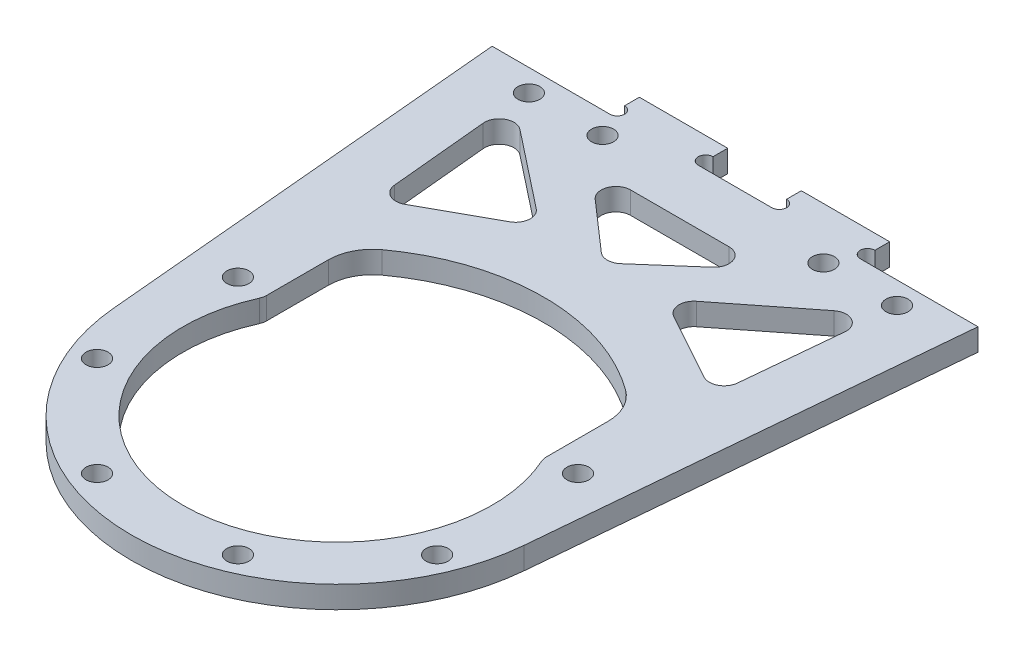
from build123d import *

# Parameters (mm, degrees)
SKETCH1_R           = 28
SKETCH1_R_2         = 13.5
SKETCH1_R_3         = 1.5
BOSS_EXTRUDE1_DEPTH = 3
SKETCH5_R           = 21
CUT_EXTRUDE4_DEPTH  = 10
BOSS_EXTRUDE2_DEPTH = 3
SKETCH7_W           = 12
SKETCH7_H           = 4
BOSS_EXTRUDE3_DEPTH = 3
SKETCH8_R           = 1
CUT_EXTRUDE5_DEPTH  = 67.798203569
SKETCH9_R           = 1.5
CUT_EXTRUDE6_DEPTH  = 67.798203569
SKETCH12_R          = 1.5
BOSS_EXTRUDE4_DEPTH = 3
CUT_EXTRUDE7_DEPTH  = 67.798203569
FILLET2_R           = 2
FILLET3_R           = 6


with BuildPart() as part:
    # Sketch1 → Boss-Extrude1 (new body)
    with BuildSketch(Plane(origin=(0, 0, 0), x_dir=(1, 0, 0), z_dir=(0, 1, 0))):
        with Locations(Location((0, 0, 0), (0, 0, 270))):
            Circle(SKETCH1_R)
        with Locations(Location((0, 0, 0), (0, 0, 270))):
            Circle(SKETCH1_R_2, mode=Mode.SUBTRACT)
        with Locations(Location((0, -17.5, 0), (0, 0, 270))):
            Circle(SKETCH1_R_3, mode=Mode.SUBTRACT)
        with Locations(Location((-17.5, 0, 0), (0, 0, 270))):
            Circle(SKETCH1_R_3, mode=Mode.SUBTRACT)
        with Locations(Location((0, 17.5, 0), (0, 0, 270))):
            Circle(SKETCH1_R_3, mode=Mode.SUBTRACT)
        with Locations(Location((17.5, 0, 0), (0, 0, 270))):
            Circle(SKETCH1_R_3, mode=Mode.SUBTRACT)
        with Locations(Location((-9.567085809, -23.096988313, 0), (0, 0, 270))):
            Circle(SKETCH1_R_3, mode=Mode.SUBTRACT)
        with Locations(Location((-23.096988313, -9.567085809, 0), (0, 0, 270))):
            Circle(SKETCH1_R_3, mode=Mode.SUBTRACT)
        with Locations(Location((-23.096988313, 9.567085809, 0), (0, 0, 270))):
            Circle(SKETCH1_R_3, mode=Mode.SUBTRACT)
        with Locations(Location((-9.567085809, 23.096988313, 0), (0, 0, 270))):
            Circle(SKETCH1_R_3, mode=Mode.SUBTRACT)
        with Locations(Location((9.567085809, 23.096988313, 0), (0, 0, 270))):
            Circle(SKETCH1_R_3, mode=Mode.SUBTRACT)
        with Locations(Location((23.096988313, 9.567085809, 0), (0, 0, 270))):
            Circle(SKETCH1_R_3, mode=Mode.SUBTRACT)
        with Locations(Location((23.096988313, -9.567085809, 0), (0, 0, 270))):
            Circle(SKETCH1_R_3, mode=Mode.SUBTRACT)
        with Locations(Location((9.567085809, -23.096988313, 0), (0, 0, 270))):
            Circle(SKETCH1_R_3, mode=Mode.SUBTRACT)
    extrude(amount=BOSS_EXTRUDE1_DEPTH)

    # Sketch5 → Cut-Extrude4 (cut)
    with BuildSketch(Plane.XZ):
        with Locations(Location((0, 0, 0), (0, 0, 270))):
            Circle(SKETCH5_R)
    extrude(amount=-CUT_EXTRUDE4_DEPTH, mode=Mode.SUBTRACT)

    # Sketch6 → Boss-Extrude2 (add, through all)
    with BuildSketch(Plane(origin=(0, 3, 0), x_dir=(1, 0, 0), z_dir=(0, 1, 0))):
        with BuildLine():
            ThreePointArc((-27.886099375, -2.522986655), (-20.671763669, 18.885925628), (0, 28))
            Line((0, 28), (0, 54))
            Line((0, 54), (-33, 54))
            Line((-33, 54), (-27.886099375, -2.522986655))
        make_face()
        with BuildLine():
            Line((0, 54), (0, 28))
            ThreePointArc((0, 28), (19.798989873, 19.798989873), (28, 0))
            ThreePointArc((28, 0), (27.97151035, -1.262778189), (27.886099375, -2.522986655))
            Line((27.886099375, -2.522986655), (33, 54))
            Line((33, 54), (0, 54))
        make_face()
    extrude(amount=-BOSS_EXTRUDE2_DEPTH)

    # Sketch7 → Boss-Extrude3 (add, through all)
    with BuildSketch(Plane(origin=(0, 3, 0), x_dir=(1, 0, 0), z_dir=(0, 1, 0))):
        with Locations((-11, 56)):
            Rectangle(SKETCH7_W, SKETCH7_H)
        with Locations((11, 56)):
            Rectangle(SKETCH7_W, SKETCH7_H)
    extrude(amount=-BOSS_EXTRUDE3_DEPTH)

    # Sketch8 → Cut-Extrude5 (cut, through all)
    with BuildSketch(Plane(origin=(0, 3, 0), x_dir=(1, 0, 0), z_dir=(0, 1, 0))):
        with Locations((-5, 55)):
            Circle(SKETCH8_R)
        with Locations((5, 55)):
            Circle(SKETCH8_R)
        with Locations((-17, 55)):
            Circle(SKETCH8_R)
        with Locations((17, 55)):
            Circle(SKETCH8_R)
    extrude(amount=-CUT_EXTRUDE5_DEPTH, mode=Mode.SUBTRACT)

    # Sketch9 → Cut-Extrude6 (cut, through all)
    with BuildSketch(Plane(origin=(0, 3, 0), x_dir=(1, 0, 0), z_dir=(0, 1, 0))):
        with Locations(Location((-25, 51, 0), (0, 0, 270))):
            Circle(SKETCH9_R)
        with Locations(Location((-15, 51, 0), (0, 0, 270))):
            Circle(SKETCH9_R)
        with Locations(Location((25, 51, 0), (0, 0, 270))):
            Circle(SKETCH9_R)
        with Locations(Location((15, 51, 0), (0, 0, 270))):
            Circle(SKETCH9_R)
    extrude(amount=-CUT_EXTRUDE6_DEPTH, mode=Mode.SUBTRACT)

    # Sketch12 → Boss-Extrude4 (add, through all)
    with BuildSketch(Plane(origin=(0, 3, 0), x_dir=(1, 0, 0), z_dir=(0, 1, 0))):
        with Locations((9.567085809, 23.096988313)):
            Circle(SKETCH12_R)
        with Locations((-9.567085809, 23.096988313)):
            Circle(SKETCH12_R)
    extrude(amount=-BOSS_EXTRUDE4_DEPTH)

    # Sketch11 → Cut-Extrude7 (cut, through all)
    with BuildSketch(Plane(origin=(0, 3, 0), x_dir=(1, 0, 0), z_dir=(0, 1, 0))):
        Polygon((25, 49), (8.5, 36), (23, 28), align=None)
        Polygon((-23, 28), (-8.5, 36), (-25, 49), align=None)
        Polygon((12, 46.5), (-12, 46.5), (0, 36), align=None)
        with BuildLine():
            Line((19, 8.94427191), (19, 20.566963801))
            ThreePointArc((19, 20.566963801), (0, 28), (-19, 20.566963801))
            Line((-19, 20.566963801), (-19, 8.94427191))
            ThreePointArc((-19, 8.94427191), (0, 21), (19, 8.94427191))
        make_face()
    extrude(amount=-CUT_EXTRUDE7_DEPTH, mode=Mode.SUBTRACT)

    # Fillet2
    fillet2_edges = [part.edges().sort_by_distance(p)[0] for p in [
        (-23, 1.5, -28),
        (-25, 1.5, -49),
        (-8.5, 1.5, -36),
        (8.5, 1.5, -36),
        (25, 1.5, -49),
        (23, 1.5, -28),
        (19, 1.5, -8.94427191),
        (-19, 1.5, -8.94427191),
        (0, 1.5, -36),
        (-12, 1.5, -46.5),
        (12, 1.5, -46.5),
    ]]
    fillet(fillet2_edges, radius=FILLET2_R)

    # Fillet3
    fillet3_edges = [part.edges().sort_by_distance(p)[0] for p in [
        (19, 1.5, -20.566963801),
        (-19, 1.5, -20.566963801),
    ]]
    fillet(fillet3_edges, radius=FILLET3_R)


solid = part.part
